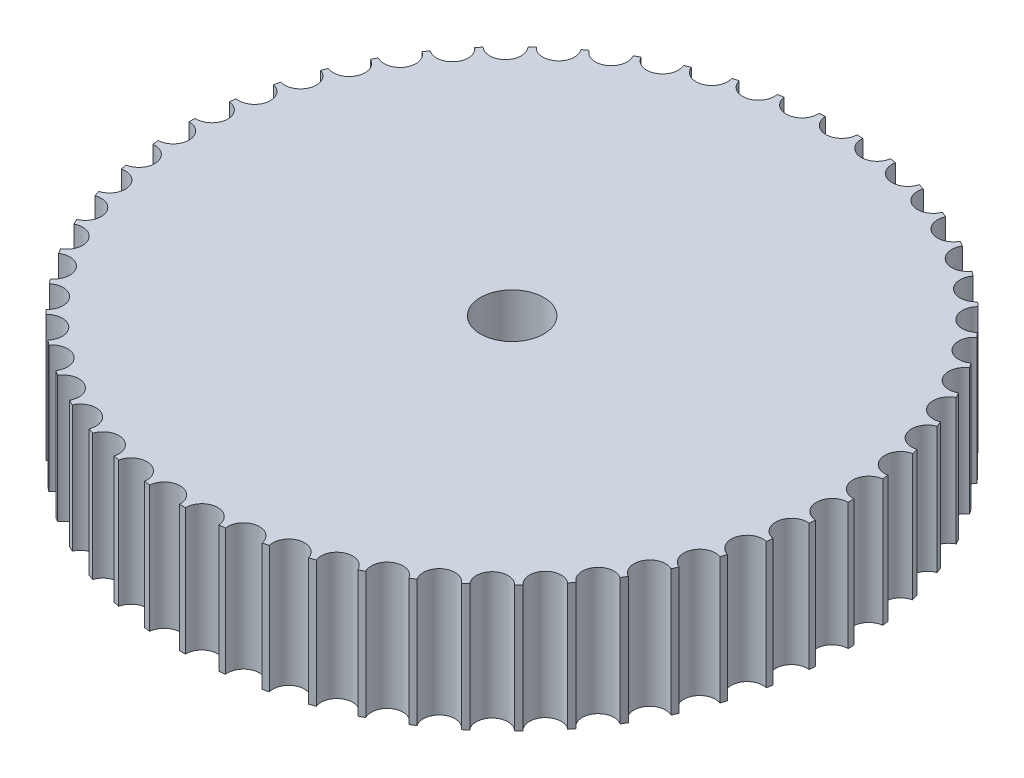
from build123d import *

# Parameters (mm, degrees)
SKETCH1_R           = 26
BOSS_EXTRUDE1_DEPTH = 10
SKETCH4_R           = 1.25
CUT_EXTRUDE1_DEPTH  = 10
SKETCH5_R           = 2.5
CUT_EXTRUDE2_DEPTH  = 10


with BuildPart() as part:
    # Sketch1 → Boss-Extrude1 (new body)
    with BuildSketch(Plane(origin=(0, 0, 0), x_dir=(1, 0, 0), z_dir=(0, 1, 0))):
        with Locations(Location((0, 0, 0), (0, 0, 270))):
            Circle(SKETCH1_R)
    extrude(amount=BOSS_EXTRUDE1_DEPTH)

    # Sketch4 → Cut-Extrude1 (cut)
    with BuildSketch(Plane(origin=(0, 10, 0), x_dir=(1, 0, 0), z_dir=(0, 1, 0))):
        with Locations((0, 26)):
            Circle(SKETCH4_R)
        with Locations((2.963776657, 25.830525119)):
            Circle(SKETCH4_R)
        with Locations((5.888915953, 25.324309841)):
            Circle(SKETCH4_R)
        with Locations((8.737284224, 24.487953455)):
            Circle(SKETCH4_R)
        with Locations((11.471748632, 23.332359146)):
            Circle(SKETCH4_R)
        with Locations((14.056661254, 21.872591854)):
            Circle(SKETCH4_R)
        with Locations((16.458323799, 20.127681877)):
            Circle(SKETCH4_R)
        with Locations((18.645426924, 18.120376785)):
            Circle(SKETCH4_R)
        with Locations((20.589458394, 15.876844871)):
            Circle(SKETCH4_R)
        with Locations((22.265074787, 13.426334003)):
            Circle(SKETCH4_R)
        with Locations((23.650431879, 10.800790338)):
            Circle(SKETCH4_R)
        with Locations((24.727469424, 8.034441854)):
            Circle(SKETCH4_R)
        with Locations((25.482146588, 5.163352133)):
            Circle(SKETCH4_R)
        with Locations((25.904625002, 2.22495022)):
            Circle(SKETCH4_R)
        with Locations((25.989397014, -0.742457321)):
            Circle(SKETCH4_R)
        with Locations((25.735357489, -3.700185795)):
            Circle(SKETCH4_R)
        with Locations((25.145818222, -6.609676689)):
            Circle(SKETCH4_R)
        with Locations((24.22846476, -9.433000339)):
            Circle(SKETCH4_R)
        with Locations((22.995256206, -12.133350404)):
            Circle(SKETCH4_R)
        with Locations((21.462269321, -14.675523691)):
            Circle(SKETCH4_R)
        with Locations((19.649488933, -17.026379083)):
            Circle(SKETCH4_R)
        with Locations((17.580547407, -19.155269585)):
            Circle(SKETCH4_R)
        with Locations((15.28241656, -21.034441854)):
            Circle(SKETCH4_R)
        with Locations((12.785056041, -22.639398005)):
            Circle(SKETCH4_R)
        with Locations((10.121022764, -23.949214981)):
            Circle(SKETCH4_R)
        with Locations((7.325046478, -24.946817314)):
            Circle(SKETCH4_R)
        with Locations((4.433577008, -25.619199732)):
            Circle(SKETCH4_R)
        with Locations((1.484309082, -25.957596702)):
            Circle(SKETCH4_R)
        with Locations((-1.484309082, -25.957596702)):
            Circle(SKETCH4_R)
        with Locations((-4.433577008, -25.619199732)):
            Circle(SKETCH4_R)
        with Locations((-7.325046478, -24.946817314)):
            Circle(SKETCH4_R)
        with Locations((-10.121022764, -23.949214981)):
            Circle(SKETCH4_R)
        with Locations((-12.785056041, -22.639398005)):
            Circle(SKETCH4_R)
        with Locations((-15.28241656, -21.034441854)):
            Circle(SKETCH4_R)
        with Locations((-17.580547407, -19.155269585)):
            Circle(SKETCH4_R)
        with Locations((-19.649488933, -17.026379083)):
            Circle(SKETCH4_R)
        with Locations((-21.462269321, -14.675523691)):
            Circle(SKETCH4_R)
        with Locations((-22.995256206, -12.133350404)):
            Circle(SKETCH4_R)
        with Locations((-24.228464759, -9.433000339)):
            Circle(SKETCH4_R)
        with Locations((-25.145818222, -6.609676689)):
            Circle(SKETCH4_R)
        with Locations((-25.735357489, -3.700185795)):
            Circle(SKETCH4_R)
        with Locations((-25.989397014, -0.742457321)):
            Circle(SKETCH4_R)
        with Locations((-25.904625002, 2.22495022)):
            Circle(SKETCH4_R)
        with Locations((-25.482146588, 5.163352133)):
            Circle(SKETCH4_R)
        with Locations((-24.727469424, 8.034441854)):
            Circle(SKETCH4_R)
        with Locations((-23.650431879, 10.800790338)):
            Circle(SKETCH4_R)
        with Locations((-22.265074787, 13.426334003)):
            Circle(SKETCH4_R)
        with Locations((-20.589458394, 15.876844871)):
            Circle(SKETCH4_R)
        with Locations((-18.645426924, 18.120376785)):
            Circle(SKETCH4_R)
        with Locations((-16.458323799, 20.127681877)):
            Circle(SKETCH4_R)
        with Locations((-14.056661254, 21.872591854)):
            Circle(SKETCH4_R)
        with Locations((-11.471748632, 23.332359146)):
            Circle(SKETCH4_R)
        with Locations((-8.737284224, 24.487953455)):
            Circle(SKETCH4_R)
        with Locations((-5.888915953, 25.32430984)):
            Circle(SKETCH4_R)
        with Locations((-2.963776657, 25.830525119)):
            Circle(SKETCH4_R)
    extrude(amount=-CUT_EXTRUDE1_DEPTH, mode=Mode.SUBTRACT)

    # Sketch5 → Cut-Extrude2 (cut)
    with BuildSketch(Plane(origin=(0, 10, 0), x_dir=(1, 0, 0), z_dir=(0, 1, 0))):
        with Locations(Location((0, 0, 0), (0, 0, 270))):
            Circle(SKETCH5_R)
    extrude(amount=-CUT_EXTRUDE2_DEPTH, mode=Mode.SUBTRACT)


solid = part.part
